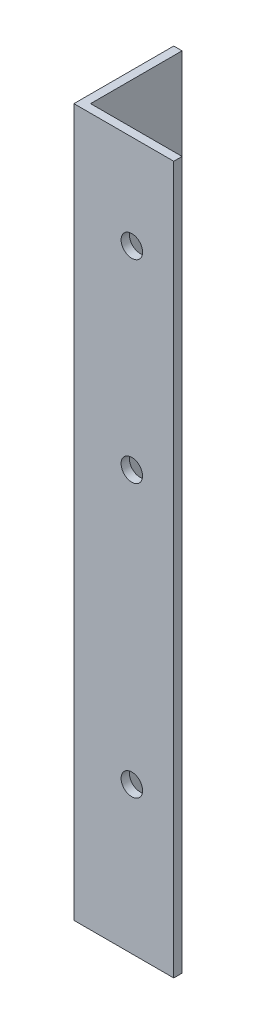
ISO-10303-21;
HEADER;
FILE_DESCRIPTION(('STEP AP214'),'2;1');
FILE_NAME('part.step','',(''),(''),'','','');
FILE_SCHEMA(('AUTOMOTIVE_DESIGN { 1 0 10303 214 1 1 1 1 }'));
ENDSEC;
DATA;
#1=APPLICATION_CONTEXT('core data for automotive mechanical design processes');
#2=APPLICATION_PROTOCOL_DEFINITION('international standard','automotive_design',2000,#1);
#3=PRODUCT_CONTEXT('',#1,'mechanical');
#4=PRODUCT('Part','Part','',(#3));
#5=PRODUCT_RELATED_PRODUCT_CATEGORY('part','',(#4));
#6=PRODUCT_DEFINITION_FORMATION('','',#4);
#7=PRODUCT_DEFINITION_CONTEXT('part definition',#1,'design');
#8=PRODUCT_DEFINITION('design','',#6,#7);
#9=PRODUCT_DEFINITION_SHAPE('','',#8);
#10=(LENGTH_UNIT() NAMED_UNIT(*) SI_UNIT(.MILLI.,.METRE.));
#11=(NAMED_UNIT(*) PLANE_ANGLE_UNIT() SI_UNIT($,.RADIAN.));
#12=(NAMED_UNIT(*) SI_UNIT($,.STERADIAN.) SOLID_ANGLE_UNIT());
#13=UNCERTAINTY_MEASURE_WITH_UNIT(LENGTH_MEASURE(1.E-05),#10,'distance_accuracy_value','');
#14=(GEOMETRIC_REPRESENTATION_CONTEXT(3) GLOBAL_UNCERTAINTY_ASSIGNED_CONTEXT((#13)) GLOBAL_UNIT_ASSIGNED_CONTEXT((#10,
#11,#12)) REPRESENTATION_CONTEXT('',''));
#15=CARTESIAN_POINT('',(0.,0.,0.));
#16=DIRECTION('',(0.,0.,1.));
#17=DIRECTION('',(1.,0.,0.));
#18=AXIS2_PLACEMENT_3D('',#15,#16,#17);
#19=CARTESIAN_POINT('',(1.5875,135.,-19.05));
#20=DIRECTION('',(0.,0.,1.));
#21=DIRECTION('',(1.,0.,0.));
#22=AXIS2_PLACEMENT_3D('',#19,#20,#21);
#23=PLANE('',#22);
#24=DIRECTION('',(0.,-1.,0.));
#25=VECTOR('',#24,1.);
#26=CARTESIAN_POINT('',(0.,135.,-19.05));
#27=LINE('',#26,#25);
#28=CARTESIAN_POINT('',(0.,10.7960606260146,-19.05));
#29=VERTEX_POINT('',#28);
#30=CARTESIAN_POINT('',(0.,0.,-19.05));
#31=VERTEX_POINT('',#30);
#32=EDGE_CURVE('E123',#29,#31,#27,.T.);
#33=ORIENTED_EDGE('',*,*,#32,.F.);
#34=DIRECTION('',(1.,0.,0.));
#35=VECTOR('',#34,1.);
#36=CARTESIAN_POINT('',(-8.4125,10.7960606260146,-19.05));
#37=LINE('',#36,#35);
#38=CARTESIAN_POINT('',(1.5875,10.7960606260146,-19.05));
#39=VERTEX_POINT('',#38);
#40=EDGE_CURVE('E110',#29,#39,#37,.T.);
#41=ORIENTED_EDGE('',*,*,#40,.T.);
#42=DIRECTION('',(0.,-1.,0.));
#43=VECTOR('',#42,1.);
#44=CARTESIAN_POINT('',(1.5875,135.,-19.05));
#45=LINE('',#44,#43);
#46=CARTESIAN_POINT('',(1.5875,0.,-19.05));
#47=VERTEX_POINT('',#46);
#48=EDGE_CURVE('E121',#39,#47,#45,.T.);
#49=ORIENTED_EDGE('',*,*,#48,.T.);
#50=DIRECTION('',(-1.,0.,0.));
#51=VECTOR('',#50,1.);
#52=CARTESIAN_POINT('',(1.5875,0.,-19.05));
#53=LINE('',#52,#51);
#54=EDGE_CURVE('E168',#47,#31,#53,.T.);
#55=ORIENTED_EDGE('',*,*,#54,.T.);
#56=EDGE_LOOP('',(#33,#41,#49,#55));
#57=FACE_BOUND('',#56,.T.);
#58=ADVANCED_FACE('F33',(#57),#23,.F.);
#59=CARTESIAN_POINT('',(1.5875,95.7960606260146,-19.05));
#60=VERTEX_POINT('',#59);
#61=CARTESIAN_POINT('',(1.5875,29.2039393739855,-19.05));
#62=VERTEX_POINT('',#61);
#63=EDGE_CURVE('E131',#60,#62,#45,.T.);
#64=ORIENTED_EDGE('',*,*,#63,.T.);
#65=DIRECTION('',(1.,0.,0.));
#66=VECTOR('',#65,1.);
#67=CARTESIAN_POINT('',(-8.4125,29.2039393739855,-19.05));
#68=LINE('',#67,#66);
#69=CARTESIAN_POINT('',(0.,29.2039393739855,-19.05));
#70=VERTEX_POINT('',#69);
#71=EDGE_CURVE('E48',#62,#70,#68,.F.);
#72=ORIENTED_EDGE('',*,*,#71,.T.);
#73=CARTESIAN_POINT('',(0.,95.7960606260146,-19.05));
#74=VERTEX_POINT('',#73);
#75=EDGE_CURVE('E136',#74,#70,#27,.T.);
#76=ORIENTED_EDGE('',*,*,#75,.F.);
#77=DIRECTION('',(1.,0.,0.));
#78=VECTOR('',#77,1.);
#79=CARTESIAN_POINT('',(-8.4125,95.7960606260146,-19.05));
#80=LINE('',#79,#78);
#81=EDGE_CURVE('E11',#74,#60,#80,.T.);
#82=ORIENTED_EDGE('',*,*,#81,.T.);
#83=EDGE_LOOP('',(#64,#72,#76,#82));
#84=FACE_BOUND('',#83,.T.);
#85=ADVANCED_FACE('F203',(#84),#23,.F.);
#86=CARTESIAN_POINT('',(0.,135.,-19.05));
#87=DIRECTION('',(1.,0.,0.));
#88=DIRECTION('',(0.,0.,-1.));
#89=AXIS2_PLACEMENT_3D('',#86,#87,#88);
#90=PLANE('',#89);
#91=CARTESIAN_POINT('',(0.,80.,-11.05));
#92=DIRECTION('',(1.,0.,0.));
#93=DIRECTION('',(0.,0.,-1.));
#94=AXIS2_PLACEMENT_3D('',#91,#92,#93);
#95=CIRCLE('',#94,2.05);
#96=CARTESIAN_POINT('',(0.,80.,-13.1));
#97=VERTEX_POINT('',#96);
#98=EDGE_CURVE('E228',#97,#97,#95,.T.);
#99=ORIENTED_EDGE('',*,*,#98,.T.);
#100=EDGE_LOOP('',(#99));
#101=FACE_BOUND('',#100,.T.);
#102=CARTESIAN_POINT('',(0.,28.,-11.05));
#103=DIRECTION('',(1.,0.,0.));
#104=DIRECTION('',(0.,0.,-1.));
#105=AXIS2_PLACEMENT_3D('',#102,#103,#104);
#106=CIRCLE('',#105,2.05000000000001);
#107=CARTESIAN_POINT('',(0.,28.,-13.1));
#108=VERTEX_POINT('',#107);
#109=EDGE_CURVE('E234',#108,#108,#106,.T.);
#110=ORIENTED_EDGE('',*,*,#109,.T.);
#111=EDGE_LOOP('',(#110));
#112=FACE_BOUND('',#111,.T.);
#113=CARTESIAN_POINT('',(0.,117.,-11.05));
#114=DIRECTION('',(1.,0.,0.));
#115=DIRECTION('',(0.,0.,-1.));
#116=AXIS2_PLACEMENT_3D('',#113,#114,#115);
#117=CIRCLE('',#116,2.05);
#118=CARTESIAN_POINT('',(0.,117.,-13.1));
#119=VERTEX_POINT('',#118);
#120=EDGE_CURVE('E187',#119,#119,#117,.T.);
#121=ORIENTED_EDGE('',*,*,#120,.T.);
#122=EDGE_LOOP('',(#121));
#123=FACE_BOUND('',#122,.T.);
#124=ORIENTED_EDGE('',*,*,#75,.T.);
#125=CARTESIAN_POINT('',(0.,20.,-21.95));
#126=DIRECTION('',(1.,0.,0.));
#127=DIRECTION('',(0.,0.,-1.));
#128=AXIS2_PLACEMENT_3D('',#125,#126,#127);
#129=CIRCLE('',#128,9.65000000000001);
#130=EDGE_CURVE('E116',#70,#29,#129,.T.);
#131=ORIENTED_EDGE('',*,*,#130,.T.);
#132=ORIENTED_EDGE('',*,*,#32,.T.);
#133=DIRECTION('',(0.,0.,1.));
#134=VECTOR('',#133,1.);
#135=CARTESIAN_POINT('',(0.,0.,-19.05));
#136=LINE('',#135,#134);
#137=CARTESIAN_POINT('',(0.,0.,0.));
#138=VERTEX_POINT('',#137);
#139=EDGE_CURVE('E184',#31,#138,#136,.T.);
#140=ORIENTED_EDGE('',*,*,#139,.T.);
#141=DIRECTION('',(0.,-1.,0.));
#142=VECTOR('',#141,1.);
#143=CARTESIAN_POINT('',(0.,135.,0.));
#144=LINE('',#143,#142);
#145=CARTESIAN_POINT('',(0.,135.,0.));
#146=VERTEX_POINT('',#145);
#147=EDGE_CURVE('E153',#146,#138,#144,.T.);
#148=ORIENTED_EDGE('',*,*,#147,.F.);
#149=DIRECTION('',(0.,0.,1.));
#150=VECTOR('',#149,1.);
#151=CARTESIAN_POINT('',(0.,135.,-19.05));
#152=LINE('',#151,#150);
#153=CARTESIAN_POINT('',(0.,135.,-19.05));
#154=VERTEX_POINT('',#153);
#155=EDGE_CURVE('E164',#154,#146,#152,.T.);
#156=ORIENTED_EDGE('',*,*,#155,.F.);
#157=CARTESIAN_POINT('',(0.,114.203939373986,-19.05));
#158=VERTEX_POINT('',#157);
#159=EDGE_CURVE('E132',#154,#158,#27,.T.);
#160=ORIENTED_EDGE('',*,*,#159,.T.);
#161=CARTESIAN_POINT('',(0.,105.,-21.95));
#162=DIRECTION('',(1.,0.,0.));
#163=DIRECTION('',(0.,0.,-1.));
#164=AXIS2_PLACEMENT_3D('',#161,#162,#163);
#165=CIRCLE('',#164,9.65000000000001);
#166=EDGE_CURVE('E56',#158,#74,#165,.T.);
#167=ORIENTED_EDGE('',*,*,#166,.T.);
#168=EDGE_LOOP('',(#124,#131,#132,#140,#148,#156,#160,#167));
#169=FACE_BOUND('',#168,.T.);
#170=ADVANCED_FACE('F35',(#101,#112,#123,#169),#90,.F.);
#171=CARTESIAN_POINT('',(0.,135.,0.));
#172=DIRECTION('',(0.,0.,-1.));
#173=DIRECTION('',(-1.,0.,0.));
#174=AXIS2_PLACEMENT_3D('',#171,#172,#173);
#175=PLANE('',#174);
#176=CARTESIAN_POINT('',(11.05,80.,0.));
#177=DIRECTION('',(0.,0.,-1.));
#178=DIRECTION('',(-1.,0.,0.));
#179=AXIS2_PLACEMENT_3D('',#176,#177,#178);
#180=CIRCLE('',#179,2.05);
#181=CARTESIAN_POINT('',(9.,80.,0.));
#182=VERTEX_POINT('',#181);
#183=EDGE_CURVE('E210',#182,#182,#180,.T.);
#184=ORIENTED_EDGE('',*,*,#183,.T.);
#185=EDGE_LOOP('',(#184));
#186=FACE_BOUND('',#185,.T.);
#187=CARTESIAN_POINT('',(11.05,28.,0.));
#188=DIRECTION('',(0.,0.,-1.));
#189=DIRECTION('',(-1.,0.,0.));
#190=AXIS2_PLACEMENT_3D('',#187,#188,#189);
#191=CIRCLE('',#190,2.05);
#192=CARTESIAN_POINT('',(9.,28.,0.));
#193=VERTEX_POINT('',#192);
#194=EDGE_CURVE('E217',#193,#193,#191,.T.);
#195=ORIENTED_EDGE('',*,*,#194,.T.);
#196=EDGE_LOOP('',(#195));
#197=FACE_BOUND('',#196,.T.);
#198=CARTESIAN_POINT('',(11.05,117.,0.));
#199=DIRECTION('',(0.,0.,-1.));
#200=DIRECTION('',(-1.,0.,0.));
#201=AXIS2_PLACEMENT_3D('',#198,#199,#200);
#202=CIRCLE('',#201,2.05);
#203=CARTESIAN_POINT('',(9.,117.,0.));
#204=VERTEX_POINT('',#203);
#205=EDGE_CURVE('E222',#204,#204,#202,.T.);
#206=ORIENTED_EDGE('',*,*,#205,.T.);
#207=EDGE_LOOP('',(#206));
#208=FACE_BOUND('',#207,.T.);
#209=DIRECTION('',(1.,0.,0.));
#210=VECTOR('',#209,1.);
#211=CARTESIAN_POINT('',(0.,0.,0.));
#212=LINE('',#211,#210);
#213=CARTESIAN_POINT('',(19.05,0.,0.));
#214=VERTEX_POINT('',#213);
#215=EDGE_CURVE('E186',#138,#214,#212,.T.);
#216=ORIENTED_EDGE('',*,*,#215,.T.);
#217=DIRECTION('',(0.,-1.,0.));
#218=VECTOR('',#217,1.);
#219=CARTESIAN_POINT('',(19.05,135.,0.));
#220=LINE('',#219,#218);
#221=CARTESIAN_POINT('',(19.05,135.,0.));
#222=VERTEX_POINT('',#221);
#223=EDGE_CURVE('E148',#222,#214,#220,.T.);
#224=ORIENTED_EDGE('',*,*,#223,.F.);
#225=DIRECTION('',(1.,0.,0.));
#226=VECTOR('',#225,1.);
#227=CARTESIAN_POINT('',(0.,135.,0.));
#228=LINE('',#227,#226);
#229=EDGE_CURVE('E167',#146,#222,#228,.T.);
#230=ORIENTED_EDGE('',*,*,#229,.F.);
#231=ORIENTED_EDGE('',*,*,#147,.T.);
#232=EDGE_LOOP('',(#216,#224,#230,#231));
#233=FACE_BOUND('',#232,.T.);
#234=ADVANCED_FACE('F355',(#186,#197,#208,#233),#175,.F.);
#235=CARTESIAN_POINT('',(19.05,135.,0.));
#236=DIRECTION('',(-1.,0.,0.));
#237=DIRECTION('',(0.,0.,1.));
#238=AXIS2_PLACEMENT_3D('',#235,#236,#237);
#239=PLANE('',#238);
#240=DIRECTION('',(0.,0.,-1.));
#241=VECTOR('',#240,1.);
#242=CARTESIAN_POINT('',(19.05,0.,0.));
#243=LINE('',#242,#241);
#244=CARTESIAN_POINT('',(19.05,0.,-1.5875));
#245=VERTEX_POINT('',#244);
#246=EDGE_CURVE('E189',#214,#245,#243,.T.);
#247=ORIENTED_EDGE('',*,*,#246,.T.);
#248=DIRECTION('',(0.,-1.,0.));
#249=VECTOR('',#248,1.);
#250=CARTESIAN_POINT('',(19.05,135.,-1.5875));
#251=LINE('',#250,#249);
#252=CARTESIAN_POINT('',(19.05,135.,-1.5875));
#253=VERTEX_POINT('',#252);
#254=EDGE_CURVE('E144',#253,#245,#251,.T.);
#255=ORIENTED_EDGE('',*,*,#254,.F.);
#256=DIRECTION('',(0.,0.,-1.));
#257=VECTOR('',#256,1.);
#258=CARTESIAN_POINT('',(19.05,135.,0.));
#259=LINE('',#258,#257);
#260=EDGE_CURVE('E170',#222,#253,#259,.T.);
#261=ORIENTED_EDGE('',*,*,#260,.F.);
#262=ORIENTED_EDGE('',*,*,#223,.T.);
#263=EDGE_LOOP('',(#247,#255,#261,#262));
#264=FACE_BOUND('',#263,.T.);
#265=ADVANCED_FACE('F255',(#264),#239,.F.);
#266=CARTESIAN_POINT('',(19.05,135.,-1.5875));
#267=DIRECTION('',(0.,0.,1.));
#268=DIRECTION('',(1.,0.,0.));
#269=AXIS2_PLACEMENT_3D('',#266,#267,#268);
#270=PLANE('',#269);
#271=CARTESIAN_POINT('',(11.05,80.,-1.5875));
#272=DIRECTION('',(0.,0.,-1.));
#273=DIRECTION('',(-1.,0.,0.));
#274=AXIS2_PLACEMENT_3D('',#271,#272,#273);
#275=CIRCLE('',#274,2.05);
#276=CARTESIAN_POINT('',(9.,80.,-1.5875));
#277=VERTEX_POINT('',#276);
#278=EDGE_CURVE('E214',#277,#277,#275,.T.);
#279=ORIENTED_EDGE('',*,*,#278,.F.);
#280=EDGE_LOOP('',(#279));
#281=FACE_BOUND('',#280,.T.);
#282=CARTESIAN_POINT('',(11.05,28.,-1.5875));
#283=DIRECTION('',(0.,0.,-1.));
#284=DIRECTION('',(-1.,0.,0.));
#285=AXIS2_PLACEMENT_3D('',#282,#283,#284);
#286=CIRCLE('',#285,2.05);
#287=CARTESIAN_POINT('',(9.,28.,-1.5875));
#288=VERTEX_POINT('',#287);
#289=EDGE_CURVE('E209',#288,#288,#286,.T.);
#290=ORIENTED_EDGE('',*,*,#289,.F.);
#291=EDGE_LOOP('',(#290));
#292=FACE_BOUND('',#291,.T.);
#293=CARTESIAN_POINT('',(11.05,117.,-1.5875));
#294=DIRECTION('',(0.,0.,-1.));
#295=DIRECTION('',(-1.,0.,0.));
#296=AXIS2_PLACEMENT_3D('',#293,#294,#295);
#297=CIRCLE('',#296,2.05);
#298=CARTESIAN_POINT('',(9.,117.,-1.5875));
#299=VERTEX_POINT('',#298);
#300=EDGE_CURVE('E213',#299,#299,#297,.T.);
#301=ORIENTED_EDGE('',*,*,#300,.F.);
#302=EDGE_LOOP('',(#301));
#303=FACE_BOUND('',#302,.T.);
#304=DIRECTION('',(-1.,0.,0.));
#305=VECTOR('',#304,1.);
#306=CARTESIAN_POINT('',(19.05,0.,-1.5875));
#307=LINE('',#306,#305);
#308=CARTESIAN_POINT('',(1.5875,0.,-1.5875));
#309=VERTEX_POINT('',#308);
#310=EDGE_CURVE('E191',#245,#309,#307,.T.);
#311=ORIENTED_EDGE('',*,*,#310,.T.);
#312=DIRECTION('',(0.,-1.,0.));
#313=VECTOR('',#312,1.);
#314=CARTESIAN_POINT('',(1.5875,135.,-1.5875));
#315=LINE('',#314,#313);
#316=CARTESIAN_POINT('',(1.5875,135.,-1.5875));
#317=VERTEX_POINT('',#316);
#318=EDGE_CURVE('E140',#317,#309,#315,.T.);
#319=ORIENTED_EDGE('',*,*,#318,.F.);
#320=DIRECTION('',(-1.,0.,0.));
#321=VECTOR('',#320,1.);
#322=CARTESIAN_POINT('',(19.05,135.,-1.5875));
#323=LINE('',#322,#321);
#324=EDGE_CURVE('E178',#253,#317,#323,.T.);
#325=ORIENTED_EDGE('',*,*,#324,.F.);
#326=ORIENTED_EDGE('',*,*,#254,.T.);
#327=EDGE_LOOP('',(#311,#319,#325,#326));
#328=FACE_BOUND('',#327,.T.);
#329=ADVANCED_FACE('F195',(#281,#292,#303,#328),#270,.F.);
#330=CARTESIAN_POINT('',(1.5875,135.,-1.5875));
#331=DIRECTION('',(-1.,0.,0.));
#332=DIRECTION('',(0.,0.,1.));
#333=AXIS2_PLACEMENT_3D('',#330,#331,#332);
#334=PLANE('',#333);
#335=CARTESIAN_POINT('',(1.5875,80.,-11.05));
#336=DIRECTION('',(1.,0.,0.));
#337=DIRECTION('',(0.,0.,-1.));
#338=AXIS2_PLACEMENT_3D('',#335,#336,#337);
#339=CIRCLE('',#338,2.05);
#340=CARTESIAN_POINT('',(1.5875,80.,-13.1));
#341=VERTEX_POINT('',#340);
#342=EDGE_CURVE('E231',#341,#341,#339,.T.);
#343=ORIENTED_EDGE('',*,*,#342,.F.);
#344=EDGE_LOOP('',(#343));
#345=FACE_BOUND('',#344,.T.);
#346=CARTESIAN_POINT('',(1.5875,28.,-11.05));
#347=DIRECTION('',(1.,0.,0.));
#348=DIRECTION('',(0.,0.,-1.));
#349=AXIS2_PLACEMENT_3D('',#346,#347,#348);
#350=CIRCLE('',#349,2.05000000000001);
#351=CARTESIAN_POINT('',(1.5875,28.,-13.1));
#352=VERTEX_POINT('',#351);
#353=EDGE_CURVE('E225',#352,#352,#350,.T.);
#354=ORIENTED_EDGE('',*,*,#353,.F.);
#355=EDGE_LOOP('',(#354));
#356=FACE_BOUND('',#355,.T.);
#357=CARTESIAN_POINT('',(1.5875,117.,-11.05));
#358=DIRECTION('',(1.,0.,0.));
#359=DIRECTION('',(0.,0.,-1.));
#360=AXIS2_PLACEMENT_3D('',#357,#358,#359);
#361=CIRCLE('',#360,2.05);
#362=CARTESIAN_POINT('',(1.5875,117.,-13.1));
#363=VERTEX_POINT('',#362);
#364=EDGE_CURVE('E174',#363,#363,#361,.T.);
#365=ORIENTED_EDGE('',*,*,#364,.F.);
#366=EDGE_LOOP('',(#365));
#367=FACE_BOUND('',#366,.T.);
#368=ORIENTED_EDGE('',*,*,#48,.F.);
#369=CARTESIAN_POINT('',(1.5875,20.,-21.95));
#370=DIRECTION('',(1.,0.,0.));
#371=DIRECTION('',(0.,0.,-1.));
#372=AXIS2_PLACEMENT_3D('',#369,#370,#371);
#373=CIRCLE('',#372,9.65000000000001);
#374=EDGE_CURVE('E107',#62,#39,#373,.T.);
#375=ORIENTED_EDGE('',*,*,#374,.F.);
#376=ORIENTED_EDGE('',*,*,#63,.F.);
#377=CARTESIAN_POINT('',(1.5875,105.,-21.95));
#378=DIRECTION('',(1.,0.,0.));
#379=DIRECTION('',(0.,0.,-1.));
#380=AXIS2_PLACEMENT_3D('',#377,#378,#379);
#381=CIRCLE('',#380,9.65000000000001);
#382=CARTESIAN_POINT('',(1.5875,114.203939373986,-19.05));
#383=VERTEX_POINT('',#382);
#384=EDGE_CURVE('E124',#383,#60,#381,.T.);
#385=ORIENTED_EDGE('',*,*,#384,.F.);
#386=CARTESIAN_POINT('',(1.5875,135.,-19.05));
#387=VERTEX_POINT('',#386);
#388=EDGE_CURVE('E134',#387,#383,#45,.T.);
#389=ORIENTED_EDGE('',*,*,#388,.F.);
#390=DIRECTION('',(0.,0.,-1.));
#391=VECTOR('',#390,1.);
#392=CARTESIAN_POINT('',(1.5875,135.,-1.5875));
#393=LINE('',#392,#391);
#394=EDGE_CURVE('E180',#317,#387,#393,.T.);
#395=ORIENTED_EDGE('',*,*,#394,.F.);
#396=ORIENTED_EDGE('',*,*,#318,.T.);
#397=DIRECTION('',(0.,0.,-1.));
#398=VECTOR('',#397,1.);
#399=CARTESIAN_POINT('',(1.5875,0.,-1.5875));
#400=LINE('',#399,#398);
#401=EDGE_CURVE('E129',#309,#47,#400,.T.);
#402=ORIENTED_EDGE('',*,*,#401,.T.);
#403=EDGE_LOOP('',(#368,#375,#376,#385,#389,#395,#396,#402));
#404=FACE_BOUND('',#403,.T.);
#405=ADVANCED_FACE('F126',(#345,#356,#367,#404),#334,.F.);
#406=ORIENTED_EDGE('',*,*,#388,.T.);
#407=DIRECTION('',(1.,0.,0.));
#408=VECTOR('',#407,1.);
#409=CARTESIAN_POINT('',(-8.4125,114.203939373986,-19.05));
#410=LINE('',#409,#408);
#411=EDGE_CURVE('E41',#383,#158,#410,.F.);
#412=ORIENTED_EDGE('',*,*,#411,.T.);
#413=ORIENTED_EDGE('',*,*,#159,.F.);
#414=DIRECTION('',(-1.,0.,0.));
#415=VECTOR('',#414,1.);
#416=CARTESIAN_POINT('',(1.5875,135.,-19.05));
#417=LINE('',#416,#415);
#418=EDGE_CURVE('E182',#387,#154,#417,.T.);
#419=ORIENTED_EDGE('',*,*,#418,.F.);
#420=EDGE_LOOP('',(#406,#412,#413,#419));
#421=FACE_BOUND('',#420,.T.);
#422=ADVANCED_FACE('F156',(#421),#23,.F.);
#423=CARTESIAN_POINT('',(0.,135.,0.));
#424=DIRECTION('',(0.,1.,0.));
#425=DIRECTION('',(0.,0.,1.));
#426=AXIS2_PLACEMENT_3D('',#423,#424,#425);
#427=PLANE('',#426);
#428=ORIENTED_EDGE('',*,*,#155,.T.);
#429=ORIENTED_EDGE('',*,*,#229,.T.);
#430=ORIENTED_EDGE('',*,*,#260,.T.);
#431=ORIENTED_EDGE('',*,*,#324,.T.);
#432=ORIENTED_EDGE('',*,*,#394,.T.);
#433=ORIENTED_EDGE('',*,*,#418,.T.);
#434=EDGE_LOOP('',(#428,#429,#430,#431,#432,#433));
#435=FACE_BOUND('',#434,.T.);
#436=ADVANCED_FACE('F253',(#435),#427,.T.);
#437=CARTESIAN_POINT('',(0.,0.,0.));
#438=DIRECTION('',(0.,1.,0.));
#439=DIRECTION('',(0.,0.,1.));
#440=AXIS2_PLACEMENT_3D('',#437,#438,#439);
#441=PLANE('',#440);
#442=ORIENTED_EDGE('',*,*,#139,.F.);
#443=ORIENTED_EDGE('',*,*,#54,.F.);
#444=ORIENTED_EDGE('',*,*,#401,.F.);
#445=ORIENTED_EDGE('',*,*,#310,.F.);
#446=ORIENTED_EDGE('',*,*,#246,.F.);
#447=ORIENTED_EDGE('',*,*,#215,.F.);
#448=EDGE_LOOP('',(#442,#443,#444,#445,#446,#447));
#449=FACE_BOUND('',#448,.T.);
#450=ADVANCED_FACE('F201',(#449),#441,.F.);
#451=CARTESIAN_POINT('',(0.,117.,-11.05));
#452=DIRECTION('',(1.,0.,0.));
#453=DIRECTION('',(0.,0.,-1.));
#454=AXIS2_PLACEMENT_3D('',#451,#452,#453);
#455=CYLINDRICAL_SURFACE('',#454,2.05);
#456=ORIENTED_EDGE('',*,*,#120,.F.);
#457=EDGE_LOOP('',(#456));
#458=FACE_BOUND('',#457,.T.);
#459=ORIENTED_EDGE('',*,*,#364,.T.);
#460=EDGE_LOOP('',(#459));
#461=FACE_BOUND('',#460,.T.);
#462=ADVANCED_FACE('F244',(#458,#461),#455,.F.);
#463=CARTESIAN_POINT('',(0.,28.,-11.05));
#464=DIRECTION('',(1.,0.,0.));
#465=DIRECTION('',(0.,0.,-1.));
#466=AXIS2_PLACEMENT_3D('',#463,#464,#465);
#467=CYLINDRICAL_SURFACE('',#466,2.05000000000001);
#468=ORIENTED_EDGE('',*,*,#109,.F.);
#469=EDGE_LOOP('',(#468));
#470=FACE_BOUND('',#469,.T.);
#471=ORIENTED_EDGE('',*,*,#353,.T.);
#472=EDGE_LOOP('',(#471));
#473=FACE_BOUND('',#472,.T.);
#474=ADVANCED_FACE('F271',(#470,#473),#467,.F.);
#475=CARTESIAN_POINT('',(0.,80.,-11.05));
#476=DIRECTION('',(1.,0.,0.));
#477=DIRECTION('',(0.,0.,-1.));
#478=AXIS2_PLACEMENT_3D('',#475,#476,#477);
#479=CYLINDRICAL_SURFACE('',#478,2.05);
#480=ORIENTED_EDGE('',*,*,#98,.F.);
#481=EDGE_LOOP('',(#480));
#482=FACE_BOUND('',#481,.T.);
#483=ORIENTED_EDGE('',*,*,#342,.T.);
#484=EDGE_LOOP('',(#483));
#485=FACE_BOUND('',#484,.T.);
#486=ADVANCED_FACE('F275',(#482,#485),#479,.F.);
#487=CARTESIAN_POINT('',(11.05,117.,0.));
#488=DIRECTION('',(0.,0.,-1.));
#489=DIRECTION('',(-1.,0.,0.));
#490=AXIS2_PLACEMENT_3D('',#487,#488,#489);
#491=CYLINDRICAL_SURFACE('',#490,2.05);
#492=ORIENTED_EDGE('',*,*,#205,.F.);
#493=EDGE_LOOP('',(#492));
#494=FACE_BOUND('',#493,.T.);
#495=ORIENTED_EDGE('',*,*,#300,.T.);
#496=EDGE_LOOP('',(#495));
#497=FACE_BOUND('',#496,.T.);
#498=ADVANCED_FACE('F279',(#494,#497),#491,.F.);
#499=CARTESIAN_POINT('',(11.05,28.,0.));
#500=DIRECTION('',(0.,0.,-1.));
#501=DIRECTION('',(-1.,0.,0.));
#502=AXIS2_PLACEMENT_3D('',#499,#500,#501);
#503=CYLINDRICAL_SURFACE('',#502,2.05);
#504=ORIENTED_EDGE('',*,*,#194,.F.);
#505=EDGE_LOOP('',(#504));
#506=FACE_BOUND('',#505,.T.);
#507=ORIENTED_EDGE('',*,*,#289,.T.);
#508=EDGE_LOOP('',(#507));
#509=FACE_BOUND('',#508,.T.);
#510=ADVANCED_FACE('F283',(#506,#509),#503,.F.);
#511=CARTESIAN_POINT('',(11.05,80.,0.));
#512=DIRECTION('',(0.,0.,-1.));
#513=DIRECTION('',(-1.,0.,0.));
#514=AXIS2_PLACEMENT_3D('',#511,#512,#513);
#515=CYLINDRICAL_SURFACE('',#514,2.05);
#516=ORIENTED_EDGE('',*,*,#183,.F.);
#517=EDGE_LOOP('',(#516));
#518=FACE_BOUND('',#517,.T.);
#519=ORIENTED_EDGE('',*,*,#278,.T.);
#520=EDGE_LOOP('',(#519));
#521=FACE_BOUND('',#520,.T.);
#522=ADVANCED_FACE('F287',(#518,#521),#515,.F.);
#523=CARTESIAN_POINT('',(-8.4125,105.,-21.95));
#524=DIRECTION('',(1.,0.,0.));
#525=DIRECTION('',(0.,0.,-1.));
#526=AXIS2_PLACEMENT_3D('',#523,#524,#525);
#527=CYLINDRICAL_SURFACE('',#526,9.65000000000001);
#528=ORIENTED_EDGE('',*,*,#166,.F.);
#529=ORIENTED_EDGE('',*,*,#411,.F.);
#530=ORIENTED_EDGE('',*,*,#384,.T.);
#531=ORIENTED_EDGE('',*,*,#81,.F.);
#532=EDGE_LOOP('',(#528,#529,#530,#531));
#533=FACE_BOUND('',#532,.T.);
#534=ADVANCED_FACE('F291',(#533),#527,.F.);
#535=CARTESIAN_POINT('',(-8.4125,20.,-21.95));
#536=DIRECTION('',(1.,0.,0.));
#537=DIRECTION('',(0.,0.,-1.));
#538=AXIS2_PLACEMENT_3D('',#535,#536,#537);
#539=CYLINDRICAL_SURFACE('',#538,9.65000000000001);
#540=ORIENTED_EDGE('',*,*,#130,.F.);
#541=ORIENTED_EDGE('',*,*,#71,.F.);
#542=ORIENTED_EDGE('',*,*,#374,.T.);
#543=ORIENTED_EDGE('',*,*,#40,.F.);
#544=EDGE_LOOP('',(#540,#541,#542,#543));
#545=FACE_BOUND('',#544,.T.);
#546=ADVANCED_FACE('F109',(#545),#539,.F.);
#547=CLOSED_SHELL('',(#58,#85,#170,#234,#265,#329,#405,#422,#436,#450,#462,#474,#486,#498,#510,
#522,#534,#546));
#548=MANIFOLD_SOLID_BREP('B2',#547);
#549=ADVANCED_BREP_SHAPE_REPRESENTATION('',(#18,#548),#14);
#550=SHAPE_DEFINITION_REPRESENTATION(#9,#549);
ENDSEC;
END-ISO-10303-21;
